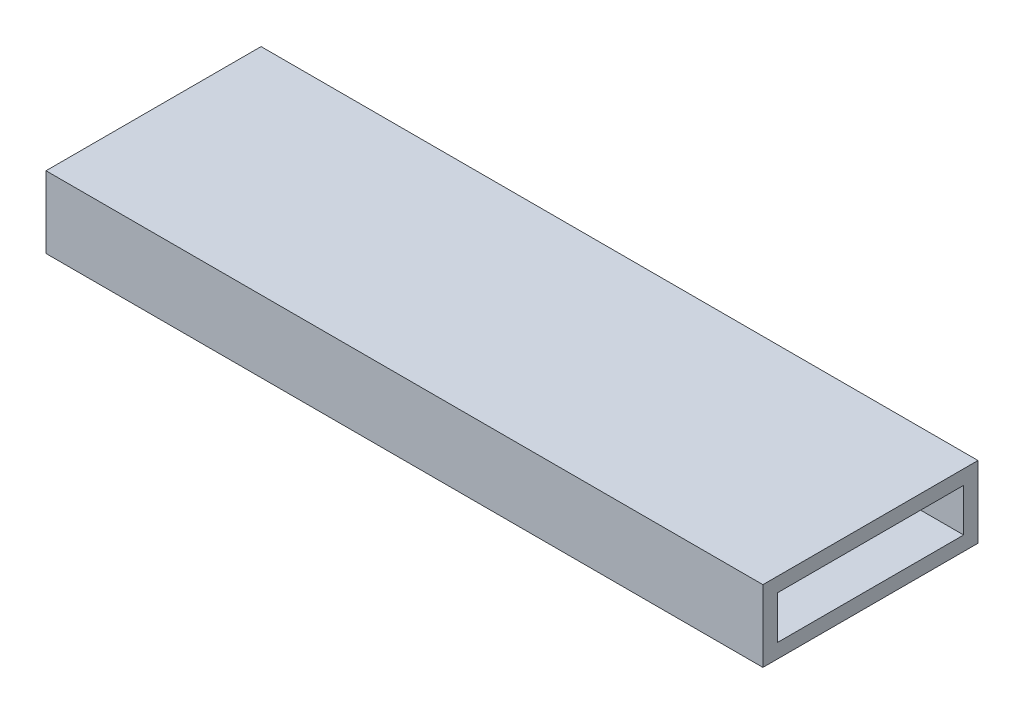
ISO-10303-21;
HEADER;
FILE_DESCRIPTION(('STEP AP214'),'2;1');
FILE_NAME('part.step','',(''),(''),'','','');
FILE_SCHEMA(('AUTOMOTIVE_DESIGN { 1 0 10303 214 1 1 1 1 }'));
ENDSEC;
DATA;
#1=APPLICATION_CONTEXT('core data for automotive mechanical design processes');
#2=APPLICATION_PROTOCOL_DEFINITION('international standard','automotive_design',2000,#1);
#3=PRODUCT_CONTEXT('',#1,'mechanical');
#4=PRODUCT('Part','Part','',(#3));
#5=PRODUCT_RELATED_PRODUCT_CATEGORY('part','',(#4));
#6=PRODUCT_DEFINITION_FORMATION('','',#4);
#7=PRODUCT_DEFINITION_CONTEXT('part definition',#1,'design');
#8=PRODUCT_DEFINITION('design','',#6,#7);
#9=PRODUCT_DEFINITION_SHAPE('','',#8);
#10=(LENGTH_UNIT() NAMED_UNIT(*) SI_UNIT(.MILLI.,.METRE.));
#11=(NAMED_UNIT(*) PLANE_ANGLE_UNIT() SI_UNIT($,.RADIAN.));
#12=(NAMED_UNIT(*) SI_UNIT($,.STERADIAN.) SOLID_ANGLE_UNIT());
#13=UNCERTAINTY_MEASURE_WITH_UNIT(LENGTH_MEASURE(1.E-05),#10,'distance_accuracy_value','');
#14=(GEOMETRIC_REPRESENTATION_CONTEXT(3) GLOBAL_UNCERTAINTY_ASSIGNED_CONTEXT((#13)) GLOBAL_UNIT_ASSIGNED_CONTEXT((#10,
#11,#12)) REPRESENTATION_CONTEXT('',''));
#15=CARTESIAN_POINT('',(0.,0.,0.));
#16=DIRECTION('',(0.,0.,1.));
#17=DIRECTION('',(1.,0.,0.));
#18=AXIS2_PLACEMENT_3D('',#15,#16,#17);
#19=CARTESIAN_POINT('',(100.,10.,0.));
#20=DIRECTION('',(0.,1.,0.));
#21=DIRECTION('',(0.,0.,1.));
#22=AXIS2_PLACEMENT_3D('',#19,#20,#21);
#23=PLANE('',#22);
#24=DIRECTION('',(0.,0.,-1.));
#25=VECTOR('',#24,1.);
#26=CARTESIAN_POINT('',(0.,10.,0.));
#27=LINE('',#26,#25);
#28=CARTESIAN_POINT('',(0.,10.,0.));
#29=VERTEX_POINT('',#28);
#30=CARTESIAN_POINT('',(0.,10.,-30.));
#31=VERTEX_POINT('',#30);
#32=EDGE_CURVE('E151',#29,#31,#27,.T.);
#33=ORIENTED_EDGE('',*,*,#32,.F.);
#34=DIRECTION('',(-1.,0.,0.));
#35=VECTOR('',#34,1.);
#36=CARTESIAN_POINT('',(100.,10.,0.));
#37=LINE('',#36,#35);
#38=CARTESIAN_POINT('',(100.,10.,0.));
#39=VERTEX_POINT('',#38);
#40=EDGE_CURVE('E11',#39,#29,#37,.T.);
#41=ORIENTED_EDGE('',*,*,#40,.F.);
#42=DIRECTION('',(0.,0.,-1.));
#43=VECTOR('',#42,1.);
#44=CARTESIAN_POINT('',(100.,10.,0.));
#45=LINE('',#44,#43);
#46=CARTESIAN_POINT('',(100.,10.,-30.));
#47=VERTEX_POINT('',#46);
#48=EDGE_CURVE('E157',#39,#47,#45,.T.);
#49=ORIENTED_EDGE('',*,*,#48,.T.);
#50=DIRECTION('',(-1.,0.,0.));
#51=VECTOR('',#50,1.);
#52=CARTESIAN_POINT('',(100.,10.,-30.));
#53=LINE('',#52,#51);
#54=EDGE_CURVE('E46',#47,#31,#53,.T.);
#55=ORIENTED_EDGE('',*,*,#54,.T.);
#56=EDGE_LOOP('',(#33,#41,#49,#55));
#57=FACE_BOUND('',#56,.T.);
#58=ADVANCED_FACE('F43',(#57),#23,.T.);
#59=CARTESIAN_POINT('',(100.,0.,0.));
#60=DIRECTION('',(0.,0.,1.));
#61=DIRECTION('',(1.,0.,0.));
#62=AXIS2_PLACEMENT_3D('',#59,#60,#61);
#63=PLANE('',#62);
#64=DIRECTION('',(0.,1.,0.));
#65=VECTOR('',#64,1.);
#66=CARTESIAN_POINT('',(0.,0.,0.));
#67=LINE('',#66,#65);
#68=CARTESIAN_POINT('',(0.,0.,0.));
#69=VERTEX_POINT('',#68);
#70=EDGE_CURVE('E162',#69,#29,#67,.T.);
#71=ORIENTED_EDGE('',*,*,#70,.F.);
#72=DIRECTION('',(-1.,0.,0.));
#73=VECTOR('',#72,1.);
#74=CARTESIAN_POINT('',(100.,0.,0.));
#75=LINE('',#74,#73);
#76=CARTESIAN_POINT('',(100.,0.,0.));
#77=VERTEX_POINT('',#76);
#78=EDGE_CURVE('E52',#77,#69,#75,.T.);
#79=ORIENTED_EDGE('',*,*,#78,.F.);
#80=DIRECTION('',(0.,1.,0.));
#81=VECTOR('',#80,1.);
#82=CARTESIAN_POINT('',(100.,0.,0.));
#83=LINE('',#82,#81);
#84=EDGE_CURVE('E168',#77,#39,#83,.T.);
#85=ORIENTED_EDGE('',*,*,#84,.T.);
#86=ORIENTED_EDGE('',*,*,#40,.T.);
#87=EDGE_LOOP('',(#71,#79,#85,#86));
#88=FACE_BOUND('',#87,.T.);
#89=ADVANCED_FACE('F204',(#88),#63,.T.);
#90=CARTESIAN_POINT('',(100.,0.,0.));
#91=DIRECTION('',(0.,1.,0.));
#92=DIRECTION('',(0.,0.,1.));
#93=AXIS2_PLACEMENT_3D('',#90,#91,#92);
#94=PLANE('',#93);
#95=DIRECTION('',(0.,0.,-1.));
#96=VECTOR('',#95,1.);
#97=CARTESIAN_POINT('',(0.,0.,0.));
#98=LINE('',#97,#96);
#99=CARTESIAN_POINT('',(0.,0.,-30.));
#100=VERTEX_POINT('',#99);
#101=EDGE_CURVE('E179',#69,#100,#98,.T.);
#102=ORIENTED_EDGE('',*,*,#101,.T.);
#103=DIRECTION('',(-1.,0.,0.));
#104=VECTOR('',#103,1.);
#105=CARTESIAN_POINT('',(100.,0.,-30.));
#106=LINE('',#105,#104);
#107=CARTESIAN_POINT('',(100.,0.,-30.));
#108=VERTEX_POINT('',#107);
#109=EDGE_CURVE('E186',#108,#100,#106,.T.);
#110=ORIENTED_EDGE('',*,*,#109,.F.);
#111=DIRECTION('',(0.,0.,-1.));
#112=VECTOR('',#111,1.);
#113=CARTESIAN_POINT('',(100.,0.,0.));
#114=LINE('',#113,#112);
#115=EDGE_CURVE('E165',#77,#108,#114,.T.);
#116=ORIENTED_EDGE('',*,*,#115,.F.);
#117=ORIENTED_EDGE('',*,*,#78,.T.);
#118=EDGE_LOOP('',(#102,#110,#116,#117));
#119=FACE_BOUND('',#118,.T.);
#120=ADVANCED_FACE('F208',(#119),#94,.F.);
#121=CARTESIAN_POINT('',(100.,0.,-30.));
#122=DIRECTION('',(0.,0.,1.));
#123=DIRECTION('',(1.,0.,0.));
#124=AXIS2_PLACEMENT_3D('',#121,#122,#123);
#125=PLANE('',#124);
#126=DIRECTION('',(0.,1.,0.));
#127=VECTOR('',#126,1.);
#128=CARTESIAN_POINT('',(0.,0.,-30.));
#129=LINE('',#128,#127);
#130=EDGE_CURVE('E175',#100,#31,#129,.T.);
#131=ORIENTED_EDGE('',*,*,#130,.T.);
#132=ORIENTED_EDGE('',*,*,#54,.F.);
#133=DIRECTION('',(0.,1.,0.));
#134=VECTOR('',#133,1.);
#135=CARTESIAN_POINT('',(100.,0.,-30.));
#136=LINE('',#135,#134);
#137=EDGE_CURVE('E161',#108,#47,#136,.T.);
#138=ORIENTED_EDGE('',*,*,#137,.F.);
#139=ORIENTED_EDGE('',*,*,#109,.T.);
#140=EDGE_LOOP('',(#131,#132,#138,#139));
#141=FACE_BOUND('',#140,.T.);
#142=ADVANCED_FACE('F198',(#141),#125,.F.);
#143=CARTESIAN_POINT('',(100.,0.,0.));
#144=DIRECTION('',(1.,0.,0.));
#145=DIRECTION('',(0.,0.,-1.));
#146=AXIS2_PLACEMENT_3D('',#143,#144,#145);
#147=PLANE('',#146);
#148=DIRECTION('',(0.,0.,1.));
#149=VECTOR('',#148,1.);
#150=CARTESIAN_POINT('',(100.,2.,-28.));
#151=LINE('',#150,#149);
#152=CARTESIAN_POINT('',(100.,2.,-28.));
#153=VERTEX_POINT('',#152);
#154=CARTESIAN_POINT('',(100.,2.,-2.));
#155=VERTEX_POINT('',#154);
#156=EDGE_CURVE('E117',#153,#155,#151,.T.);
#157=ORIENTED_EDGE('',*,*,#156,.T.);
#158=DIRECTION('',(0.,-1.,0.));
#159=VECTOR('',#158,1.);
#160=CARTESIAN_POINT('',(100.,8.,-2.));
#161=LINE('',#160,#159);
#162=CARTESIAN_POINT('',(100.,8.,-2.));
#163=VERTEX_POINT('',#162);
#164=EDGE_CURVE('E108',#163,#155,#161,.T.);
#165=ORIENTED_EDGE('',*,*,#164,.F.);
#166=DIRECTION('',(0.,0.,1.));
#167=VECTOR('',#166,1.);
#168=CARTESIAN_POINT('',(100.,8.,-28.));
#169=LINE('',#168,#167);
#170=CARTESIAN_POINT('',(100.,8.,-28.));
#171=VERTEX_POINT('',#170);
#172=EDGE_CURVE('E116',#171,#163,#169,.T.);
#173=ORIENTED_EDGE('',*,*,#172,.F.);
#174=DIRECTION('',(0.,-1.,0.));
#175=VECTOR('',#174,1.);
#176=CARTESIAN_POINT('',(100.,8.,-28.));
#177=LINE('',#176,#175);
#178=EDGE_CURVE('E123',#171,#153,#177,.T.);
#179=ORIENTED_EDGE('',*,*,#178,.T.);
#180=EDGE_LOOP('',(#157,#165,#173,#179));
#181=FACE_BOUND('',#180,.T.);
#182=ORIENTED_EDGE('',*,*,#48,.F.);
#183=ORIENTED_EDGE('',*,*,#84,.F.);
#184=ORIENTED_EDGE('',*,*,#115,.T.);
#185=ORIENTED_EDGE('',*,*,#137,.T.);
#186=EDGE_LOOP('',(#182,#183,#184,#185));
#187=FACE_BOUND('',#186,.T.);
#188=ADVANCED_FACE('F125',(#181,#187),#147,.T.);
#189=CARTESIAN_POINT('',(0.,0.,0.));
#190=DIRECTION('',(1.,0.,0.));
#191=DIRECTION('',(0.,0.,-1.));
#192=AXIS2_PLACEMENT_3D('',#189,#190,#191);
#193=PLANE('',#192);
#194=DIRECTION('',(0.,-1.,0.));
#195=VECTOR('',#194,1.);
#196=CARTESIAN_POINT('',(0.,8.,-2.));
#197=LINE('',#196,#195);
#198=CARTESIAN_POINT('',(0.,8.,-2.));
#199=VERTEX_POINT('',#198);
#200=CARTESIAN_POINT('',(0.,2.,-2.));
#201=VERTEX_POINT('',#200);
#202=EDGE_CURVE('E142',#199,#201,#197,.T.);
#203=ORIENTED_EDGE('',*,*,#202,.T.);
#204=DIRECTION('',(0.,0.,1.));
#205=VECTOR('',#204,1.);
#206=CARTESIAN_POINT('',(0.,2.,-28.));
#207=LINE('',#206,#205);
#208=CARTESIAN_POINT('',(0.,2.,-28.));
#209=VERTEX_POINT('',#208);
#210=EDGE_CURVE('E68',#209,#201,#207,.T.);
#211=ORIENTED_EDGE('',*,*,#210,.F.);
#212=DIRECTION('',(0.,-1.,0.));
#213=VECTOR('',#212,1.);
#214=CARTESIAN_POINT('',(0.,8.,-28.));
#215=LINE('',#214,#213);
#216=CARTESIAN_POINT('',(0.,8.,-28.));
#217=VERTEX_POINT('',#216);
#218=EDGE_CURVE('E129',#217,#209,#215,.T.);
#219=ORIENTED_EDGE('',*,*,#218,.F.);
#220=DIRECTION('',(0.,0.,1.));
#221=VECTOR('',#220,1.);
#222=CARTESIAN_POINT('',(0.,8.,-28.));
#223=LINE('',#222,#221);
#224=EDGE_CURVE('E133',#217,#199,#223,.T.);
#225=ORIENTED_EDGE('',*,*,#224,.T.);
#226=EDGE_LOOP('',(#203,#211,#219,#225));
#227=FACE_BOUND('',#226,.T.);
#228=ORIENTED_EDGE('',*,*,#32,.T.);
#229=ORIENTED_EDGE('',*,*,#130,.F.);
#230=ORIENTED_EDGE('',*,*,#101,.F.);
#231=ORIENTED_EDGE('',*,*,#70,.T.);
#232=EDGE_LOOP('',(#228,#229,#230,#231));
#233=FACE_BOUND('',#232,.T.);
#234=ADVANCED_FACE('F201',(#227,#233),#193,.F.);
#235=CARTESIAN_POINT('',(100.,2.,-28.));
#236=DIRECTION('',(0.,-1.,0.));
#237=DIRECTION('',(0.,0.,-1.));
#238=AXIS2_PLACEMENT_3D('',#235,#236,#237);
#239=PLANE('',#238);
#240=ORIENTED_EDGE('',*,*,#210,.T.);
#241=DIRECTION('',(-1.,0.,0.));
#242=VECTOR('',#241,1.);
#243=CARTESIAN_POINT('',(100.,2.,-2.));
#244=LINE('',#243,#242);
#245=EDGE_CURVE('E110',#155,#201,#244,.T.);
#246=ORIENTED_EDGE('',*,*,#245,.F.);
#247=ORIENTED_EDGE('',*,*,#156,.F.);
#248=DIRECTION('',(-1.,0.,0.));
#249=VECTOR('',#248,1.);
#250=CARTESIAN_POINT('',(100.,2.,-28.));
#251=LINE('',#250,#249);
#252=EDGE_CURVE('E148',#153,#209,#251,.T.);
#253=ORIENTED_EDGE('',*,*,#252,.T.);
#254=EDGE_LOOP('',(#240,#246,#247,#253));
#255=FACE_BOUND('',#254,.T.);
#256=ADVANCED_FACE('F120',(#255),#239,.F.);
#257=CARTESIAN_POINT('',(100.,8.,-28.));
#258=DIRECTION('',(0.,0.,-1.));
#259=DIRECTION('',(-1.,0.,0.));
#260=AXIS2_PLACEMENT_3D('',#257,#258,#259);
#261=PLANE('',#260);
#262=ORIENTED_EDGE('',*,*,#218,.T.);
#263=ORIENTED_EDGE('',*,*,#252,.F.);
#264=ORIENTED_EDGE('',*,*,#178,.F.);
#265=DIRECTION('',(-1.,0.,0.));
#266=VECTOR('',#265,1.);
#267=CARTESIAN_POINT('',(100.,8.,-28.));
#268=LINE('',#267,#266);
#269=EDGE_CURVE('E152',#171,#217,#268,.T.);
#270=ORIENTED_EDGE('',*,*,#269,.T.);
#271=EDGE_LOOP('',(#262,#263,#264,#270));
#272=FACE_BOUND('',#271,.T.);
#273=ADVANCED_FACE('F264',(#272),#261,.F.);
#274=CARTESIAN_POINT('',(100.,8.,-28.));
#275=DIRECTION('',(0.,-1.,0.));
#276=DIRECTION('',(0.,0.,-1.));
#277=AXIS2_PLACEMENT_3D('',#274,#275,#276);
#278=PLANE('',#277);
#279=ORIENTED_EDGE('',*,*,#224,.F.);
#280=ORIENTED_EDGE('',*,*,#269,.F.);
#281=ORIENTED_EDGE('',*,*,#172,.T.);
#282=DIRECTION('',(-1.,0.,0.));
#283=VECTOR('',#282,1.);
#284=CARTESIAN_POINT('',(100.,8.,-2.));
#285=LINE('',#284,#283);
#286=EDGE_CURVE('E60',#163,#199,#285,.T.);
#287=ORIENTED_EDGE('',*,*,#286,.T.);
#288=EDGE_LOOP('',(#279,#280,#281,#287));
#289=FACE_BOUND('',#288,.T.);
#290=ADVANCED_FACE('F274',(#289),#278,.T.);
#291=CARTESIAN_POINT('',(100.,8.,-2.));
#292=DIRECTION('',(0.,0.,-1.));
#293=DIRECTION('',(0.,1.,0.));
#294=AXIS2_PLACEMENT_3D('',#291,#292,#293);
#295=PLANE('',#294);
#296=ORIENTED_EDGE('',*,*,#202,.F.);
#297=ORIENTED_EDGE('',*,*,#286,.F.);
#298=ORIENTED_EDGE('',*,*,#164,.T.);
#299=ORIENTED_EDGE('',*,*,#245,.T.);
#300=EDGE_LOOP('',(#296,#297,#298,#299));
#301=FACE_BOUND('',#300,.T.);
#302=ADVANCED_FACE('F109',(#301),#295,.T.);
#303=CLOSED_SHELL('',(#58,#89,#120,#142,#188,#234,#256,#273,#290,#302));
#304=MANIFOLD_SOLID_BREP('B2',#303);
#305=ADVANCED_BREP_SHAPE_REPRESENTATION('',(#18,#304),#14);
#306=SHAPE_DEFINITION_REPRESENTATION(#9,#305);
ENDSEC;
END-ISO-10303-21;
